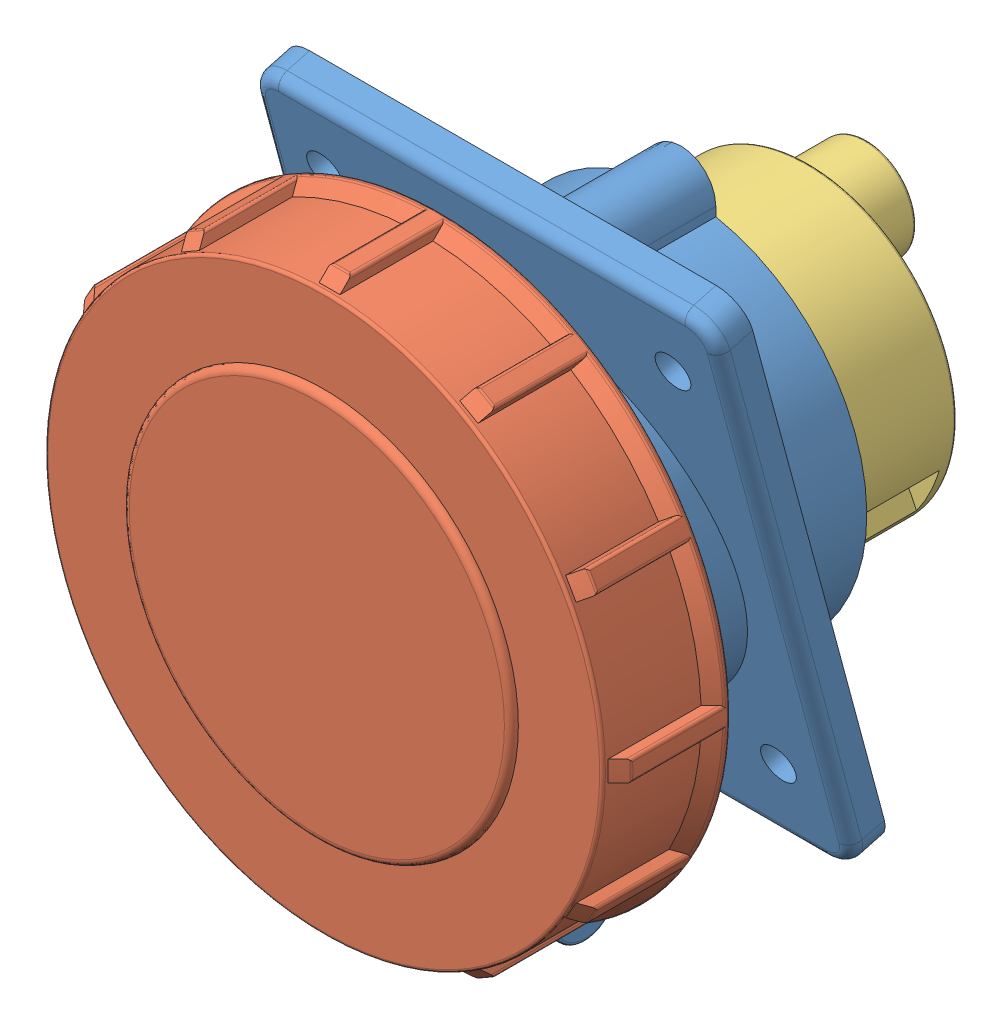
SolidWorks assembly Сборка 4252.SLDASM, configuration По умолчанию (file format 10000). Lengths in mm.
Overall size (100 105.18 94.7).
3 component instances, 3 part files, 5 mates.
Components (placement in the parent):
- Корпус 4252-1: Корпус 4252.SLDPRT [По умолчанию] at (56.7276 64.5549 37.3108) size (80 105.18 52)
- Крышка 3242,3252,4242,4252-1: Крышка 3242,3252,4242,4252.SLDPRT [По умолчанию] at (56.7276 64.5549 100.3108) x (1 0 0) z (0 0 -1) size (100 105 35.2)
- Колодка 3252,4252-1: Колодка 3252,4252.SLDPRT [По умолчанию] at (56.7276 64.5549 16.8108) x (-0.00294 -0.999996 0) z (0 0 1) size (51 51 32)
Mates (geometry in assembly coordinates):
- Концентричный1: concentric aligned: cylinder of Корпус 4252-1 through (56.7276 64.5549 89.3108) axis (0 0 -1) radius 32; cylinder of Крышка 3242,3252,4242,4252-1 through (56.7276 64.5549 89.3108) axis (0 0 -1) radius 45
- Совпадение1: coincident anti-aligned: plane of Корпус 4252-1 through (56.7276 64.5549 89.3108) normal (0 0 1); plane of Крышка 3242,3252,4242,4252-1 through (56.7276 64.5549 89.3108) normal (0 0 -1)
- Параллельность1: parallel aligned: plane of Корпус 4252-1 through (73.2276 15.0549 71.8108) normal (1 0 0); plane of Крышка 3242,3252,4242,4252-1 through (68.2276 23.065 78.2333) normal (1 0 0)
- Концентричный2: concentric aligned: cylinder of Корпус 4252-1 through (56.7276 64.5549 83.3108) axis (0 0 -1) radius 24; cylinder of Колодка 3252,4252-1 through (56.7276 64.5549 38.8108) axis (0 0 -1) radius 25.5
- Совпадение2: coincident anti-aligned: plane of Корпус 4252-1 through (56.7276 64.5549 38.8108) normal (0 0 -1); plane of Колодка 3252,4252-1 through (56.7276 64.5549 38.8108) normal (0 0 1)
